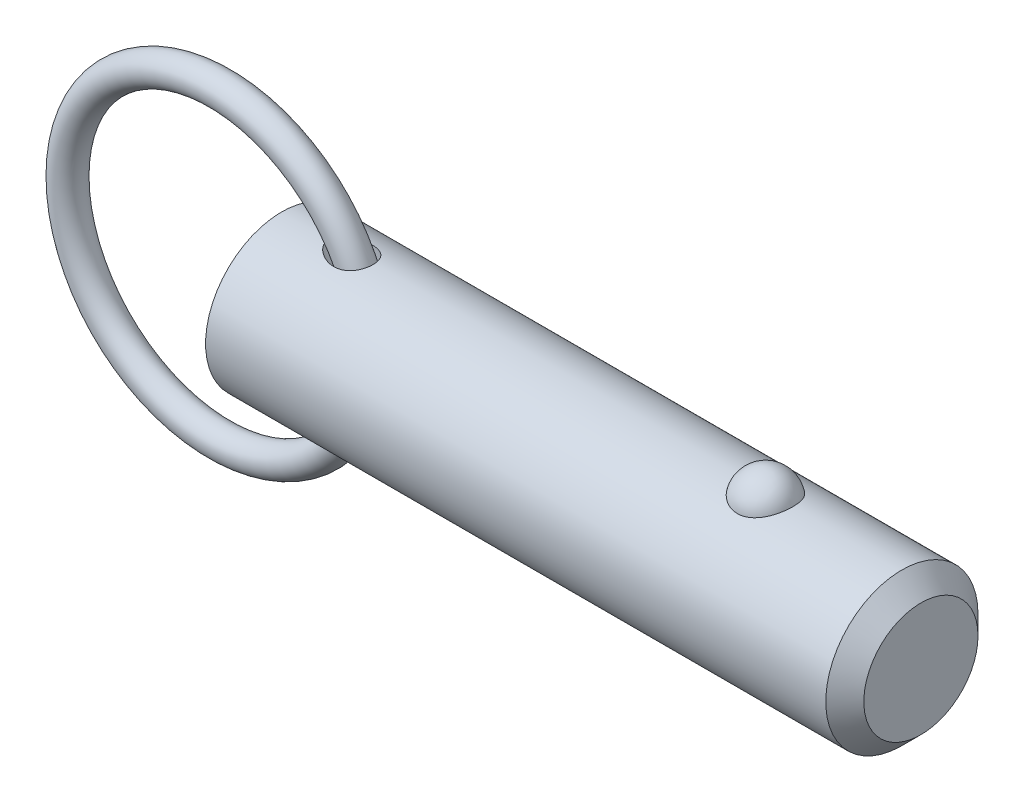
ISO-10303-21;
HEADER;
FILE_DESCRIPTION(('STEP AP214'),'2;1');
FILE_NAME('part.step','',(''),(''),'','','');
FILE_SCHEMA(('AUTOMOTIVE_DESIGN { 1 0 10303 214 1 1 1 1 }'));
ENDSEC;
DATA;
#1=APPLICATION_CONTEXT('core data for automotive mechanical design processes');
#2=APPLICATION_PROTOCOL_DEFINITION('international standard','automotive_design',2000,#1);
#3=PRODUCT_CONTEXT('',#1,'mechanical');
#4=PRODUCT('Part','Part','',(#3));
#5=PRODUCT_RELATED_PRODUCT_CATEGORY('part','',(#4));
#6=PRODUCT_DEFINITION_FORMATION('','',#4);
#7=PRODUCT_DEFINITION_CONTEXT('part definition',#1,'design');
#8=PRODUCT_DEFINITION('design','',#6,#7);
#9=PRODUCT_DEFINITION_SHAPE('','',#8);
#10=(LENGTH_UNIT() NAMED_UNIT(*) SI_UNIT(.MILLI.,.METRE.));
#11=(NAMED_UNIT(*) PLANE_ANGLE_UNIT() SI_UNIT($,.RADIAN.));
#12=(NAMED_UNIT(*) SI_UNIT($,.STERADIAN.) SOLID_ANGLE_UNIT());
#13=UNCERTAINTY_MEASURE_WITH_UNIT(LENGTH_MEASURE(1.E-05),#10,'distance_accuracy_value','');
#14=(GEOMETRIC_REPRESENTATION_CONTEXT(3) GLOBAL_UNCERTAINTY_ASSIGNED_CONTEXT((#13)) GLOBAL_UNIT_ASSIGNED_CONTEXT((#10,
#11,#12)) REPRESENTATION_CONTEXT('',''));
#15=CARTESIAN_POINT('',(0.,0.,0.));
#16=DIRECTION('',(0.,0.,1.));
#17=DIRECTION('',(1.,0.,0.));
#18=AXIS2_PLACEMENT_3D('',#15,#16,#17);
#19=CARTESIAN_POINT('',(-6.46799987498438,0.,0.));
#20=DIRECTION('',(0.,0.,1.));
#21=DIRECTION('',(1.,0.,0.));
#22=AXIS2_PLACEMENT_3D('',#19,#20,#21);
#23=TOROIDAL_SURFACE('',#22,15.875,1.588);
#24=CARTESIAN_POINT('',(10.9950001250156,0.,0.));
#25=VERTEX_POINT('',#24);
#26=VERTEX_LOOP('',#25);
#27=FACE_BOUND('',#26,.T.);
#28=ADVANCED_FACE('P0_F12',(#27),#23,.T.);
#29=CLOSED_SHELL('',(#28));
#30=MANIFOLD_SOLID_BREP('P0_B1',#29);
#31=CARTESIAN_POINT('',(0.,0.,0.));
#32=DIRECTION('',(1.,0.,0.));
#33=DIRECTION('',(0.,0.,-1.));
#34=AXIS2_PLACEMENT_3D('',#31,#32,#33);
#35=CYLINDRICAL_SURFACE('',#34,7.94);
#36=CARTESIAN_POINT('',(5.37881269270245,7.8641200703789,-1.0950869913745));
#37=CARTESIAN_POINT('',(5.49078530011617,7.84653010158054,-1.22142628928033));
#38=CARTESIAN_POINT('',(5.61742164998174,7.82766483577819,-1.33478448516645));
#39=CARTESIAN_POINT('',(5.82155225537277,7.80005811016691,-1.48501770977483));
#40=CARTESIAN_POINT('',(5.89211597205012,7.79095331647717,-1.53186949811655));
#41=CARTESIAN_POINT('',(6.03726296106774,7.77331484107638,-1.61899652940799));
#42=CARTESIAN_POINT('',(6.11184478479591,7.76478095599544,-1.65927412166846));
#43=CARTESIAN_POINT('',(6.31831542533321,7.74290334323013,-1.75933205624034));
#44=CARTESIAN_POINT('',(6.45343253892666,7.73042593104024,-1.81276183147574));
#45=CARTESIAN_POINT('',(6.73017339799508,7.70966096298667,-1.89912673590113));
#46=CARTESIAN_POINT('',(6.8717909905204,7.70136953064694,-1.93208083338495));
#47=CARTESIAN_POINT('',(7.17522096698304,7.6896684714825,-1.97820987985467));
#48=CARTESIAN_POINT('',(7.33750100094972,7.68691980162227,-1.98871513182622));
#49=CARTESIAN_POINT('',(7.5799424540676,7.68880305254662,-1.98137951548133));
#50=CARTESIAN_POINT('',(7.66059155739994,7.69043175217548,-1.97508575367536));
#51=CARTESIAN_POINT('',(7.82077465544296,7.69570110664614,-1.95445819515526));
#52=CARTESIAN_POINT('',(7.90030910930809,7.69934090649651,-1.94012781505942));
#53=CARTESIAN_POINT('',(8.09280087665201,7.71066069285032,-1.89475688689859));
#54=CARTESIAN_POINT('',(8.20465204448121,7.71942251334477,-1.85909462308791));
#55=CARTESIAN_POINT('',(8.42059371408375,7.74035594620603,-1.7699066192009));
#56=CARTESIAN_POINT('',(8.52468939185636,7.75252525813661,-1.7163929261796));
#57=CARTESIAN_POINT('',(8.72211003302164,7.77903750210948,-1.59192358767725));
#58=CARTESIAN_POINT('',(8.81539818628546,7.79338749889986,-1.52091076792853));
#59=CARTESIAN_POINT('',(8.98759177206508,7.8225086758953,-1.36321590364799));
#60=CARTESIAN_POINT('',(9.06649712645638,7.83727985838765,-1.27653377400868));
#61=CARTESIAN_POINT('',(9.20311499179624,7.86453692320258,-1.09567667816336));
#62=CARTESIAN_POINT('',(9.26180839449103,7.8771064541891,-1.00225329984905));
#63=CARTESIAN_POINT('',(9.36257622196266,7.89954213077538,-0.806547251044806));
#64=CARTESIAN_POINT('',(9.40465301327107,7.9094086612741,-0.704265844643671));
#65=CARTESIAN_POINT('',(9.47062404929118,7.92520709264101,-0.495461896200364));
#66=CARTESIAN_POINT('',(9.4947881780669,7.9311972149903,-0.38902885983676));
#67=CARTESIAN_POINT('',(9.52544004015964,7.93883641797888,-0.17349446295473));
#68=CARTESIAN_POINT('',(9.53192786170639,7.94048552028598,-0.0643931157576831));
#69=CARTESIAN_POINT('',(9.52707996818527,7.93926454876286,0.153487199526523));
#70=CARTESIAN_POINT('',(9.51572796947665,7.93639034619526,0.262265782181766));
#71=CARTESIAN_POINT('',(9.47542322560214,7.92642470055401,0.47631311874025));
#72=CARTESIAN_POINT('',(9.44647056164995,7.91933327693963,0.581581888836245));
#73=CARTESIAN_POINT('',(9.3716401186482,7.90170355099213,0.785602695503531));
#74=CARTESIAN_POINT('',(9.32576415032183,7.89116561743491,0.884355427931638));
#75=CARTESIAN_POINT('',(9.21823065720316,7.8677977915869,1.07254831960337));
#76=CARTESIAN_POINT('',(9.15657431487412,7.85496807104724,1.16198917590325));
#77=CARTESIAN_POINT('',(9.01919194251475,7.82843688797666,1.32903649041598));
#78=CARTESIAN_POINT('',(8.94347744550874,7.81473614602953,1.40665255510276));
#79=CARTESIAN_POINT('',(8.78012086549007,7.7879321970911,1.5481977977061));
#80=CARTESIAN_POINT('',(8.69247914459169,7.77482897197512,1.61212739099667));
#81=CARTESIAN_POINT('',(8.50642314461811,7.75037063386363,1.72592270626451));
#82=CARTESIAN_POINT('',(8.40786430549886,7.73904540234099,1.77555777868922));
#83=CARTESIAN_POINT('',(8.2039870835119,7.71943979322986,1.85894844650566));
#84=CARTESIAN_POINT('',(8.0986670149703,7.7111601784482,1.89270006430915));
#85=CARTESIAN_POINT('',(7.87703213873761,7.69782475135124,1.94625652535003));
#86=CARTESIAN_POINT('',(7.76044899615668,7.69301557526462,1.96500324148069));
#87=CARTESIAN_POINT('',(7.52574256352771,7.68770484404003,1.98567257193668));
#88=CARTESIAN_POINT('',(7.40761868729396,7.68720497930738,1.98758858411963));
#89=CARTESIAN_POINT('',(7.15639592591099,7.69044495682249,1.97502233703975));
#90=CARTESIAN_POINT('',(7.02341871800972,7.69476380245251,1.9583009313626));
#91=CARTESIAN_POINT('',(6.76125891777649,7.70776394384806,1.90648094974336));
#92=CARTESIAN_POINT('',(6.6320804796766,7.71644984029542,1.87136299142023));
#93=CARTESIAN_POINT('',(6.35978215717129,7.73875442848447,1.77707737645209));
#94=CARTESIAN_POINT('',(6.2177212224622,7.75293863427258,1.71496895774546));
#95=CARTESIAN_POINT('',(5.94559201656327,7.78383102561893,1.56880760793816));
#96=CARTESIAN_POINT('',(5.81552062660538,7.80053855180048,1.48476040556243));
#97=CARTESIAN_POINT('',(5.60081087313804,7.83035955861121,1.31701356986));
#98=CARTESIAN_POINT('',(5.51265224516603,7.84340226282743,1.23780647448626));
#99=CARTESIAN_POINT('',(5.34976240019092,7.86852524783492,1.06647953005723));
#100=CARTESIAN_POINT('',(5.27500719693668,7.88060722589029,0.974383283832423));
#101=CARTESIAN_POINT('',(5.15877594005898,7.89990441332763,0.800548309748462));
#102=CARTESIAN_POINT('',(5.11360209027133,7.90759876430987,0.721348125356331));
#103=CARTESIAN_POINT('',(5.03655060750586,7.92090267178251,0.556518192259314));
#104=CARTESIAN_POINT('',(5.00466157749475,7.92651401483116,0.470894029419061));
#105=CARTESIAN_POINT('',(4.95653766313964,7.93503671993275,0.294356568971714));
#106=CARTESIAN_POINT('',(4.94043621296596,7.93792505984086,0.203404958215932));
#107=CARTESIAN_POINT('',(4.92605720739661,7.94050250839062,0.0200631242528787));
#108=CARTESIAN_POINT('',(4.92776929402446,7.9401934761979,-0.0723262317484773));
#109=CARTESIAN_POINT('',(4.94742735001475,7.93667454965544,-0.243250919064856));
#110=CARTESIAN_POINT('',(4.96327131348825,7.93384031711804,-0.322048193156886));
#111=CARTESIAN_POINT('',(5.00707570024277,7.92609115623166,-0.476058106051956));
#112=CARTESIAN_POINT('',(5.03503965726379,7.92117562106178,-0.55126969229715));
#113=CARTESIAN_POINT('',(5.10737112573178,7.90866290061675,-0.709995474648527));
#114=CARTESIAN_POINT('',(5.15379379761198,7.90074105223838,-0.792541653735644));
#115=CARTESIAN_POINT('',(5.2582083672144,7.88338732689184,-0.949781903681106));
#116=CARTESIAN_POINT('',(5.31621941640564,7.87395295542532,-1.02446265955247));
#117=CARTESIAN_POINT('',(5.37881269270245,7.8641200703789,-1.0950869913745));
#118=B_SPLINE_CURVE_WITH_KNOTS('',3,(#36,#37,#38,#39,#40,#41,#42,#43,#44,#45,#46,#47,#48,#49,
#50,#51,#52,#53,#54,#55,#56,#57,#58,#59,#60,#61,#62,#63,#64,#65,#66,#67,#68,#69,#70,#71,#72,#73,
#74,#75,#76,#77,#78,#79,#80,#81,#82,#83,#84,#85,#86,#87,#88,#89,#90,#91,#92,#93,#94,#95,#96,#97,
#98,#99,#100,#101,#102,#103,#104,#105,#106,#107,#108,#109,#110,#111,#112,#113,#114,#115,#116,
#117),.UNSPECIFIED.,.T.,.F.,(4,2,2,2,2,2,2,2,2,2,2,2,2,2,2,2,2,2,2,2,2,2,2,2,2,2,2,2,2,2,2,2,2,
2,2,2,2,2,2,2,4),(0.,0.508599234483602,0.763935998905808,1.01918131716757,1.45492798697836,
1.89027038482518,2.37502798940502,2.61739702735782,2.8596631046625,3.21120678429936,
3.56251370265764,3.91498401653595,4.26745624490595,4.59897839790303,4.93045331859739,
5.25682643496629,5.58319792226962,5.909867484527,6.23653553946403,6.56316865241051,
6.88977729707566,7.21611917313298,7.54245114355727,7.87378632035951,8.20520442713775,
8.55832700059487,8.91158808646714,9.31234018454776,9.71351536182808,10.1786231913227,
10.6436096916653,11.0001264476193,11.3559986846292,11.6294791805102,11.9027245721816,
12.1782599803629,12.4536351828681,12.693828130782,12.9340911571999,13.2179277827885,
13.5022374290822),.UNSPECIFIED.);
#119=CARTESIAN_POINT('',(5.37881269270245,7.8641200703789,-1.0950869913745));
#120=VERTEX_POINT('',#119);
#121=EDGE_CURVE('P1_E40',#120,#120,#118,.T.);
#122=ORIENTED_EDGE('',*,*,#121,.T.);
#123=EDGE_LOOP('',(#122));
#124=FACE_BOUND('',#123,.T.);
#125=CARTESIAN_POINT('',(64.695,0.,0.));
#126=DIRECTION('',(1.,0.,0.));
#127=DIRECTION('',(0.,0.,-1.));
#128=AXIS2_PLACEMENT_3D('',#125,#126,#127);
#129=CIRCLE('',#128,7.94);
#130=CARTESIAN_POINT('',(64.695,0.,-7.94));
#131=VERTEX_POINT('',#130);
#132=EDGE_CURVE('P1_E25',#131,#131,#129,.T.);
#133=ORIENTED_EDGE('',*,*,#132,.F.);
#134=EDGE_LOOP('',(#133));
#135=FACE_BOUND('',#134,.T.);
#136=CARTESIAN_POINT('',(0.,0.,0.));
#137=DIRECTION('',(1.,0.,0.));
#138=DIRECTION('',(0.,0.,-1.));
#139=AXIS2_PLACEMENT_3D('',#136,#137,#138);
#140=CIRCLE('',#139,7.94);
#141=CARTESIAN_POINT('',(0.,0.,-7.94));
#142=VERTEX_POINT('',#141);
#143=EDGE_CURVE('P1_E9',#142,#142,#140,.T.);
#144=ORIENTED_EDGE('',*,*,#143,.T.);
#145=EDGE_LOOP('',(#144));
#146=FACE_BOUND('',#145,.T.);
#147=CARTESIAN_POINT('',(50.4649074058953,7.37767842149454,2.93486986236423));
#148=CARTESIAN_POINT('',(50.3127496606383,7.3776732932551,2.93487505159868));
#149=CARTESIAN_POINT('',(50.1606329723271,7.38258419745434,2.92262454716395));
#150=CARTESIAN_POINT('',(49.8609284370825,7.40163229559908,2.87404196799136));
#151=CARTESIAN_POINT('',(49.7133394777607,7.41576720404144,2.83771585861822));
#152=CARTESIAN_POINT('',(49.4270187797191,7.4516157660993,2.74218769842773));
#153=CARTESIAN_POINT('',(49.2882745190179,7.47331841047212,2.68301886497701));
#154=CARTESIAN_POINT('',(49.0228822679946,7.52194082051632,2.54350967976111));
#155=CARTESIAN_POINT('',(48.8962366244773,7.5488615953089,2.46316523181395));
#156=CARTESIAN_POINT('',(48.6545349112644,7.60594671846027,2.2809037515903));
#157=CARTESIAN_POINT('',(48.5399065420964,7.63618114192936,2.17844211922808));
#158=CARTESIAN_POINT('',(48.3288787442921,7.69614046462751,1.95608495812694));
#159=CARTESIAN_POINT('',(48.2324826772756,7.72586526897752,1.83618622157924));
#160=CARTESIAN_POINT('',(48.0559381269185,7.78314821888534,1.57628086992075));
#161=CARTESIAN_POINT('',(47.9767072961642,7.81055035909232,1.43561546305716));
#162=CARTESIAN_POINT('',(47.8417979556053,7.85879631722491,1.14236334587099));
#163=CARTESIAN_POINT('',(47.7861216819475,7.87963951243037,0.98977550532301));
#164=CARTESIAN_POINT('',(47.6988121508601,7.91289645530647,0.674619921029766));
#165=CARTESIAN_POINT('',(47.6675309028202,7.925186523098,0.511941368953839));
#166=CARTESIAN_POINT('',(47.630975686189,7.93958930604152,0.183247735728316));
#167=CARTESIAN_POINT('',(47.6257012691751,7.94170219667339,0.017232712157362));
#168=CARTESIAN_POINT('',(47.6412311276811,7.93554931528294,-0.312672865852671));
#169=CARTESIAN_POINT('',(47.6619253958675,7.92732732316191,-0.4765694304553));
#170=CARTESIAN_POINT('',(47.7287865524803,7.90141534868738,-0.798305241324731));
#171=CARTESIAN_POINT('',(47.7749539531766,7.88372517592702,-0.956144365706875));
#172=CARTESIAN_POINT('',(47.8918986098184,7.84066230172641,-1.26152073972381));
#173=CARTESIAN_POINT('',(47.9627046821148,7.81528060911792,-1.40904568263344));
#174=CARTESIAN_POINT('',(48.1274789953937,7.7594867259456,-1.68950598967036));
#175=CARTESIAN_POINT('',(48.2214488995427,7.72907417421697,-1.82244030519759));
#176=CARTESIAN_POINT('',(48.4308391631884,7.66640424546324,-2.07032792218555));
#177=CARTESIAN_POINT('',(48.5463152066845,7.63414223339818,-2.1852330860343));
#178=CARTESIAN_POINT('',(48.7959006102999,7.57149681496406,-2.39329737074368));
#179=CARTESIAN_POINT('',(48.9300080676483,7.54111321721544,-2.48645870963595));
#180=CARTESIAN_POINT('',(49.2101113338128,7.48650742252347,-2.64628132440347));
#181=CARTESIAN_POINT('',(49.3557605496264,7.46215900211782,-2.71350554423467));
#182=CARTESIAN_POINT('',(49.6574259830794,7.42171253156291,-2.82226614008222));
#183=CARTESIAN_POINT('',(49.8134383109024,7.40561140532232,-2.86381209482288));
#184=CARTESIAN_POINT('',(50.1229708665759,7.3842679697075,-2.9183907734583));
#185=CARTESIAN_POINT('',(50.2762229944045,7.37852109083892,-2.93275024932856));
#186=CARTESIAN_POINT('',(50.5830705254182,7.37700973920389,-2.93655208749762));
#187=CARTESIAN_POINT('',(50.7366658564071,7.38124333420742,-2.92599927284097));
#188=CARTESIAN_POINT('',(51.0349907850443,7.39890635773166,-2.88102897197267));
#189=CARTESIAN_POINT('',(51.1798480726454,7.41205491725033,-2.8473399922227));
#190=CARTESIAN_POINT('',(51.4616432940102,7.445801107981,-2.75788206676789));
#191=CARTESIAN_POINT('',(51.5985805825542,7.46639934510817,-2.70211132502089));
#192=CARTESIAN_POINT('',(51.8640619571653,7.51339098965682,-2.56858908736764));
#193=CARTESIAN_POINT('',(51.9923548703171,7.53990200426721,-2.49038067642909));
#194=CARTESIAN_POINT('',(52.2342440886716,7.59569503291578,-2.31462737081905));
#195=CARTESIAN_POINT('',(52.3478370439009,7.6249776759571,-2.21707808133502));
#196=CARTESIAN_POINT('',(52.56322156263,7.68489473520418,-1.99982049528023));
#197=CARTESIAN_POINT('',(52.6641488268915,7.71552419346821,-1.87925337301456));
#198=CARTESIAN_POINT('',(52.8451866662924,7.77353016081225,-1.62268826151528));
#199=CARTESIAN_POINT('',(52.9252934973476,7.80090608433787,-1.4866875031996));
#200=CARTESIAN_POINT('',(53.0653615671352,7.85047992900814,-1.19818413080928));
#201=CARTESIAN_POINT('',(53.1245877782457,7.87248183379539,-1.04529016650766));
#202=CARTESIAN_POINT('',(53.2179821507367,7.90785114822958,-0.731080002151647));
#203=CARTESIAN_POINT('',(53.2521497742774,7.92121837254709,-0.569763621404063));
#204=CARTESIAN_POINT('',(53.294795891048,7.93797834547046,-0.242812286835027));
#205=CARTESIAN_POINT('',(53.3032047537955,7.94134405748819,-0.0771668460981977));
#206=CARTESIAN_POINT('',(53.2939626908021,7.93767937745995,0.253276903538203));
#207=CARTESIAN_POINT('',(53.2763120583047,7.93064910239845,0.418075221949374));
#208=CARTESIAN_POINT('',(53.215424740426,7.90695571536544,0.741525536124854));
#209=CARTESIAN_POINT('',(53.1722819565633,7.8903279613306,0.900197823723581));
#210=CARTESIAN_POINT('',(53.0613535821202,7.84916386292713,1.20759654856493));
#211=CARTESIAN_POINT('',(52.99356656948,7.82462706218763,1.35632241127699));
#212=CARTESIAN_POINT('',(52.8343718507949,7.7700669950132,1.64032869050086));
#213=CARTESIAN_POINT('',(52.7428616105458,7.7400200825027,1.77554712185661));
#214=CARTESIAN_POINT('',(52.5382960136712,7.67774175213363,2.02800648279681));
#215=CARTESIAN_POINT('',(52.4252410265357,7.64551037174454,2.14524772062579));
#216=CARTESIAN_POINT('',(52.1808318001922,7.58265895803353,2.35778002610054));
#217=CARTESIAN_POINT('',(52.0495833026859,7.55203092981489,2.45319004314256));
#218=CARTESIAN_POINT('',(51.771601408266,7.49579792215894,2.61999897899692));
#219=CARTESIAN_POINT('',(51.6248670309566,7.47019326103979,2.69139637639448));
#220=CARTESIAN_POINT('',(51.3129477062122,7.42622216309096,2.8105324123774));
#221=CARTESIAN_POINT('',(51.1472209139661,7.40825002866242,2.85700910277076));
#222=CARTESIAN_POINT('',(50.8092792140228,7.38398348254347,2.9191685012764));
#223=CARTESIAN_POINT('',(50.6370670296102,7.3776842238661,2.93486399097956));
#224=CARTESIAN_POINT('',(50.4649074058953,7.37767842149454,2.93486986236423));
#225=B_SPLINE_CURVE_WITH_KNOTS('',3,(#147,#148,#149,#150,#151,#152,#153,#154,#155,#156,#157,
#158,#159,#160,#161,#162,#163,#164,#165,#166,#167,#168,#169,#170,#171,#172,#173,#174,#175,#176,
#177,#178,#179,#180,#181,#182,#183,#184,#185,#186,#187,#188,#189,#190,#191,#192,#193,#194,#195,
#196,#197,#198,#199,#200,#201,#202,#203,#204,#205,#206,#207,#208,#209,#210,#211,#212,#213,#214,
#215,#216,#217,#218,#219,#220,#221,#222,#223,#224),.UNSPECIFIED.,.T.,.F.,(4,2,2,2,2,2,2,2,2,2,2,
2,2,2,2,2,2,2,2,2,2,2,2,2,2,2,2,2,2,2,2,2,2,2,2,2,2,2,4),(0.,0.45584132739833,0.911569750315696,
1.36663794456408,1.82179423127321,2.28978983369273,2.7578716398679,3.246853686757,
3.73588214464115,4.23184282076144,4.72779494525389,5.22165321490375,5.71552141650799,
6.20996917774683,6.70445245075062,7.20023431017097,7.69596557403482,8.18023418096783,
8.66432203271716,9.12410697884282,9.58380291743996,10.0296503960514,10.4755341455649,
10.9312349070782,11.3870393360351,11.8654416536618,12.3439299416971,12.8378875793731,
13.3318558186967,13.8271581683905,14.3224549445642,14.8159385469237,15.3094506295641,
15.8051323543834,16.3008055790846,16.7937101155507,17.2866458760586,17.8026240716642,
18.3183879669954),.UNSPECIFIED.);
#226=CARTESIAN_POINT('',(50.4649074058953,7.37767842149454,2.93486986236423));
#227=VERTEX_POINT('',#226);
#228=EDGE_CURVE('P1_E34',#227,#227,#225,.T.);
#229=ORIENTED_EDGE('',*,*,#228,.T.);
#230=EDGE_LOOP('',(#229));
#231=FACE_BOUND('',#230,.T.);
#232=CARTESIAN_POINT('',(5.37881269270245,-7.8641200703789,-1.0950869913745));
#233=CARTESIAN_POINT('',(5.31532711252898,-7.87409326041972,-1.02345575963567));
#234=CARTESIAN_POINT('',(5.25654962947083,-7.88365715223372,-0.947641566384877));
#235=CARTESIAN_POINT('',(5.15093536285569,-7.90122221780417,-0.787865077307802));
#236=CARTESIAN_POINT('',(5.10408931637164,-7.90922460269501,-0.703909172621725));
#237=CARTESIAN_POINT('',(5.02499142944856,-7.92292057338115,-0.5279916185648));
#238=CARTESIAN_POINT('',(4.99290048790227,-7.92858863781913,-0.435954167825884));
#239=CARTESIAN_POINT('',(4.94718343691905,-7.93670712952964,-0.247266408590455));
#240=CARTESIAN_POINT('',(4.93353142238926,-7.93916207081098,-0.150622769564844));
#241=CARTESIAN_POINT('',(4.92669426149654,-7.94038957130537,0.0306459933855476));
#242=CARTESIAN_POINT('',(4.9310562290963,-7.93960347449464,0.115182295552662));
#243=CARTESIAN_POINT('',(4.95441758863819,-7.93542535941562,0.2821331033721));
#244=CARTESIAN_POINT('',(4.97342060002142,-7.93203269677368,0.364547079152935));
#245=CARTESIAN_POINT('',(5.02337664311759,-7.92322764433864,0.521528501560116));
#246=CARTESIAN_POINT('',(5.05377582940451,-7.91790920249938,0.596281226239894));
#247=CARTESIAN_POINT('',(5.1246872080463,-7.90571364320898,0.740640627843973));
#248=CARTESIAN_POINT('',(5.16520358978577,-7.89883588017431,0.810245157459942));
#249=CARTESIAN_POINT('',(5.27792634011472,-7.88012470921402,0.97862022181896));
#250=CARTESIAN_POINT('',(5.35563200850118,-7.86757912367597,1.07363778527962));
#251=CARTESIAN_POINT('',(5.52523836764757,-7.84150676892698,1.24994147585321));
#252=CARTESIAN_POINT('',(5.61717506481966,-7.82797755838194,1.33119164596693));
#253=CARTESIAN_POINT('',(5.83913717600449,-7.79742756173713,1.50104748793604));
#254=CARTESIAN_POINT('',(5.9725742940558,-7.78050347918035,1.58521567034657));
#255=CARTESIAN_POINT('',(6.25160600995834,-7.74942135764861,1.73078109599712));
#256=CARTESIAN_POINT('',(6.39720857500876,-7.73526515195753,1.79216327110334));
#257=CARTESIAN_POINT('',(6.69793322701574,-7.7116170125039,1.89134478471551));
#258=CARTESIAN_POINT('',(6.85312134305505,-7.70216275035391,1.92895428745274));
#259=CARTESIAN_POINT('',(7.16781951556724,-7.68988337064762,1.97736316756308));
#260=CARTESIAN_POINT('',(7.32732244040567,-7.68704791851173,1.98820434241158));
#261=CARTESIAN_POINT('',(7.61290770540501,-7.68890797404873,1.98097687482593));
#262=CARTESIAN_POINT('',(7.73913797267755,-7.69217875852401,1.96837928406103));
#263=CARTESIAN_POINT('',(7.98774248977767,-7.70364253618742,1.92303262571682));
#264=CARTESIAN_POINT('',(8.11011880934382,-7.71183283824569,1.89029457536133));
#265=CARTESIAN_POINT('',(8.34766306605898,-7.73253074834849,1.80375920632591));
#266=CARTESIAN_POINT('',(8.46278682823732,-7.74506226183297,1.74984505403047));
#267=CARTESIAN_POINT('',(8.6806268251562,-7.77294147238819,1.62149891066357));
#268=CARTESIAN_POINT('',(8.78334736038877,-7.78828818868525,1.54707406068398));
#269=CARTESIAN_POINT('',(8.96275951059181,-7.81808719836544,1.38814746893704));
#270=CARTESIAN_POINT('',(9.0410292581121,-7.83247448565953,1.30540890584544));
#271=CARTESIAN_POINT('',(9.18176824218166,-7.86008608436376,1.1272733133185));
#272=CARTESIAN_POINT('',(9.24424163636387,-7.87331070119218,1.03187962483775));
#273=CARTESIAN_POINT('',(9.34924815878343,-7.89649032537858,0.83568428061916));
#274=CARTESIAN_POINT('',(9.39252490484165,-7.90656172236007,0.735293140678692));
#275=CARTESIAN_POINT('',(9.46188913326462,-7.92307290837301,0.528458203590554));
#276=CARTESIAN_POINT('',(9.48797767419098,-7.92951292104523,0.422014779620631));
#277=CARTESIAN_POINT('',(9.5222867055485,-7.93804067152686,0.206589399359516));
#278=CARTESIAN_POINT('',(9.53058328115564,-7.94014694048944,0.0976202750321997));
#279=CARTESIAN_POINT('',(9.52935292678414,-7.93983698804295,-0.120212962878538));
#280=CARTESIAN_POINT('',(9.51982577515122,-7.93742071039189,-0.229077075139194));
#281=CARTESIAN_POINT('',(9.48313466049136,-7.92831916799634,-0.443751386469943));
#282=CARTESIAN_POINT('',(9.45594838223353,-7.92162850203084,-0.549557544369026));
#283=CARTESIAN_POINT('',(9.38454658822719,-7.90469917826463,-0.754954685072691));
#284=CARTESIAN_POINT('',(9.34033171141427,-7.89446065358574,-0.854545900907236));
#285=CARTESIAN_POINT('',(9.23602927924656,-7.87157146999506,-1.04456732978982));
#286=CARTESIAN_POINT('',(9.17596171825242,-7.85892385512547,-1.13500888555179));
#287=CARTESIAN_POINT('',(9.0415343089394,-7.83259746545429,-1.30436780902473));
#288=CARTESIAN_POINT('',(8.96717562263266,-7.81891877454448,-1.38328611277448));
#289=CARTESIAN_POINT('',(8.80603455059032,-7.79196869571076,-1.52782923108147));
#290=CARTESIAN_POINT('',(8.71921490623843,-7.77869867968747,-1.59341269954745));
#291=CARTESIAN_POINT('',(8.53589430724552,-7.7539823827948,-1.7096493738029));
#292=CARTESIAN_POINT('',(8.43939269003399,-7.74253622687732,-1.76030155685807));
#293=CARTESIAN_POINT('',(8.23614706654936,-7.72219212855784,-1.84754820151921));
#294=CARTESIAN_POINT('',(8.12916866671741,-7.71339202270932,-1.88361685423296));
#295=CARTESIAN_POINT('',(7.91082287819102,-7.69955300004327,-1.93940887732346));
#296=CARTESIAN_POINT('',(7.79945379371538,-7.69451555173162,-1.95912586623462));
#297=CARTESIAN_POINT('',(7.56409927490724,-7.6881073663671,-1.98413612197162));
#298=CARTESIAN_POINT('',(7.43993744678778,-7.68713944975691,-1.98784574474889));
#299=CARTESIAN_POINT('',(7.19239878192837,-7.68969629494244,-1.97792309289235));
#300=CARTESIAN_POINT('',(7.0690222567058,-7.69322274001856,-1.96428432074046));
#301=CARTESIAN_POINT('',(6.80624991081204,-7.70498367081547,-1.91768089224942));
#302=CARTESIAN_POINT('',(6.667361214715,-7.71386737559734,-1.88203087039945));
#303=CARTESIAN_POINT('',(6.39625444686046,-7.73551250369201,-1.79098714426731));
#304=CARTESIAN_POINT('',(6.26404857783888,-7.74828074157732,-1.73555871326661));
#305=CARTESIAN_POINT('',(6.06559048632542,-7.77003865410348,-1.63446133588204));
#306=CARTESIAN_POINT('',(5.99591479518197,-7.77821880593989,-1.59522999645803));
#307=CARTESIAN_POINT('',(5.86025875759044,-7.79503524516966,-1.51091846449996));
#308=CARTESIAN_POINT('',(5.79427944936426,-7.8036716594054,-1.46583664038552));
#309=CARTESIAN_POINT('',(5.60322733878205,-7.82978128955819,-1.3219827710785));
#310=CARTESIAN_POINT('',(5.48449649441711,-7.84751780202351,-1.21433077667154));
#311=CARTESIAN_POINT('',(5.37881269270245,-7.8641200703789,-1.0950869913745));
#312=B_SPLINE_CURVE_WITH_KNOTS('',3,(#232,#233,#234,#235,#236,#237,#238,#239,#240,#241,#242,
#243,#244,#245,#246,#247,#248,#249,#250,#251,#252,#253,#254,#255,#256,#257,#258,#259,#260,#261,
#262,#263,#264,#265,#266,#267,#268,#269,#270,#271,#272,#273,#274,#275,#276,#277,#278,#279,#280,
#281,#282,#283,#284,#285,#286,#287,#288,#289,#290,#291,#292,#293,#294,#295,#296,#297,#298,#299,
#300,#301,#302,#303,#304,#305,#306,#307,#308,#309,#310,#311),.UNSPECIFIED.,.T.,.F.,(4,2,2,2,2,2,
2,2,2,2,2,2,2,2,2,2,2,2,2,2,2,2,2,2,2,2,2,2,2,2,2,2,2,2,2,2,2,2,2,4),(0.,0.288363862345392,
0.576503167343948,0.867714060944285,1.15851540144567,1.41111828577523,1.66378363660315,
1.90549406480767,2.1473047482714,2.51540453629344,2.88445136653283,3.35805159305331,
3.83196445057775,4.30961543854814,4.78652012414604,5.16565662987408,5.54458592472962,
5.92563591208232,6.30655339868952,6.64920782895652,6.99177197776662,7.31956587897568,
7.64733959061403,7.97370879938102,8.30008206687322,8.62686856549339,8.95364280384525,
9.28000684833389,9.60634436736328,9.93367879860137,10.261035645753,10.59932199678,
10.9377403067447,11.308967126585,11.6803330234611,12.1096921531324,12.5398088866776,
12.7806650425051,13.0215885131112,13.5016249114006),.UNSPECIFIED.);
#313=CARTESIAN_POINT('',(5.37881269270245,-7.8641200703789,-1.0950869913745));
#314=VERTEX_POINT('',#313);
#315=EDGE_CURVE('P1_E17',#314,#314,#312,.T.);
#316=ORIENTED_EDGE('',*,*,#315,.T.);
#317=EDGE_LOOP('',(#316));
#318=FACE_BOUND('',#317,.T.);
#319=ADVANCED_FACE('P1_F13',(#124,#135,#146,#231,#318),#35,.T.);
#320=CARTESIAN_POINT('',(0.,0.,0.));
#321=DIRECTION('',(-1.,0.,0.));
#322=DIRECTION('',(0.,0.,1.));
#323=AXIS2_PLACEMENT_3D('',#320,#321,#322);
#324=PLANE('',#323);
#325=ORIENTED_EDGE('',*,*,#143,.F.);
#326=EDGE_LOOP('',(#325));
#327=FACE_BOUND('',#326,.T.);
#328=ADVANCED_FACE('P1_F15',(#327),#324,.T.);
#329=CARTESIAN_POINT('',(66.68,0.,0.));
#330=DIRECTION('',(-1.,0.,0.));
#331=DIRECTION('',(0.,0.,1.));
#332=AXIS2_PLACEMENT_3D('',#329,#330,#331);
#333=CONICAL_SURFACE('',#332,5.95500000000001,0.785398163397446);
#334=ORIENTED_EDGE('',*,*,#132,.T.);
#335=EDGE_LOOP('',(#334));
#336=FACE_BOUND('',#335,.T.);
#337=CARTESIAN_POINT('',(66.68,0.,0.));
#338=DIRECTION('',(1.,0.,0.));
#339=DIRECTION('',(0.,0.,-1.));
#340=AXIS2_PLACEMENT_3D('',#337,#338,#339);
#341=CIRCLE('',#340,5.95500000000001);
#342=CARTESIAN_POINT('',(66.68,0.,-5.95500000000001));
#343=VERTEX_POINT('',#342);
#344=EDGE_CURVE('P1_E30',#343,#343,#341,.T.);
#345=ORIENTED_EDGE('',*,*,#344,.F.);
#346=EDGE_LOOP('',(#345));
#347=FACE_BOUND('',#346,.T.);
#348=ADVANCED_FACE('P1_F55',(#336,#347),#333,.T.);
#349=CARTESIAN_POINT('',(66.68,5.95500000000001,0.));
#350=DIRECTION('',(1.,0.,0.));
#351=DIRECTION('',(0.,0.,-1.));
#352=AXIS2_PLACEMENT_3D('',#349,#350,#351);
#353=PLANE('',#352);
#354=ORIENTED_EDGE('',*,*,#344,.T.);
#355=EDGE_LOOP('',(#354));
#356=FACE_BOUND('',#355,.T.);
#357=ADVANCED_FACE('P1_F51',(#356),#353,.T.);
#358=CARTESIAN_POINT('',(50.4649074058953,7.146,0.));
#359=DIRECTION('',(-1.,0.,0.));
#360=DIRECTION('',(0.,1.,0.));
#361=AXIS2_PLACEMENT_3D('',#358,#359,#360);
#362=SPHERICAL_SURFACE('',#361,2.944);
#363=ORIENTED_EDGE('',*,*,#228,.F.);
#364=EDGE_LOOP('',(#363));
#365=FACE_BOUND('',#364,.T.);
#366=ADVANCED_FACE('P1_F46',(#365),#362,.T.);
#367=CARTESIAN_POINT('',(-6.46799987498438,0.,0.));
#368=DIRECTION('',(0.,0.,1.));
#369=DIRECTION('',(1.,0.,0.));
#370=AXIS2_PLACEMENT_3D('',#367,#368,#369);
#371=TOROIDAL_SURFACE('',#370,15.875,1.985);
#372=ORIENTED_EDGE('',*,*,#315,.F.);
#373=EDGE_LOOP('',(#372));
#374=FACE_BOUND('',#373,.T.);
#375=ORIENTED_EDGE('',*,*,#121,.F.);
#376=EDGE_LOOP('',(#375));
#377=FACE_BOUND('',#376,.T.);
#378=ADVANCED_FACE('P1_F50',(#374,#377),#371,.F.);
#379=CLOSED_SHELL('',(#319,#328,#348,#357,#366,#378));
#380=MANIFOLD_SOLID_BREP('P1_B1',#379);
#381=ADVANCED_BREP_SHAPE_REPRESENTATION('',(#18,#30,#380),#14);
#382=SHAPE_DEFINITION_REPRESENTATION(#9,#381);
ENDSEC;
END-ISO-10303-21;
